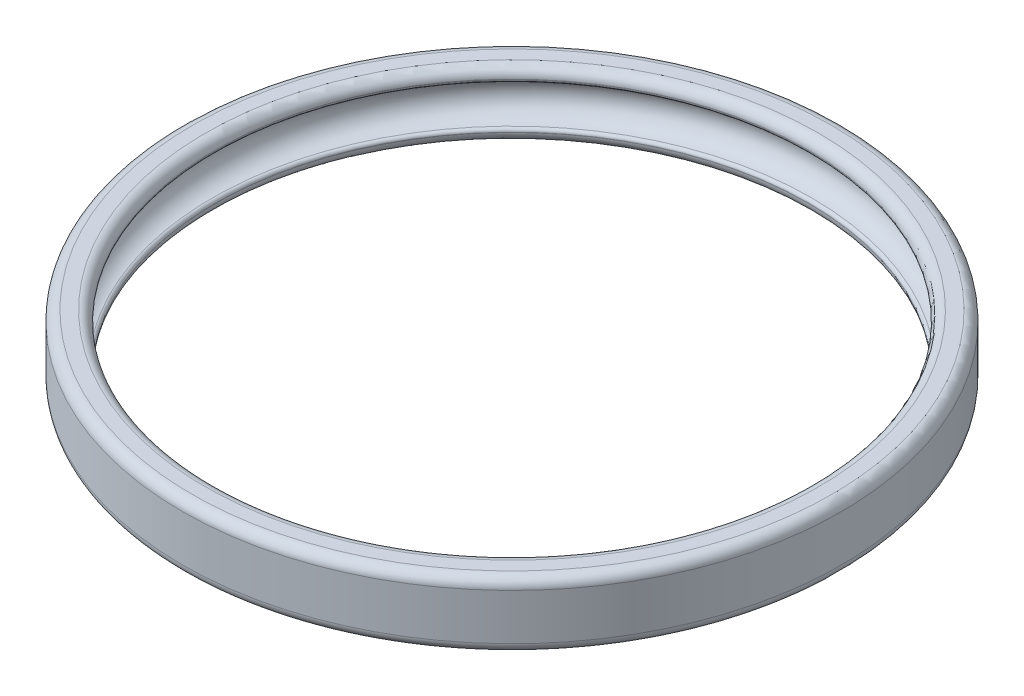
ISO-10303-21;
HEADER;
FILE_DESCRIPTION(('STEP AP214'),'2;1');
FILE_NAME('part.step','',(''),(''),'','','');
FILE_SCHEMA(('AUTOMOTIVE_DESIGN { 1 0 10303 214 1 1 1 1 }'));
ENDSEC;
DATA;
#1=APPLICATION_CONTEXT('core data for automotive mechanical design processes');
#2=APPLICATION_PROTOCOL_DEFINITION('international standard','automotive_design',2000,#1);
#3=PRODUCT_CONTEXT('',#1,'mechanical');
#4=PRODUCT('Part','Part','',(#3));
#5=PRODUCT_RELATED_PRODUCT_CATEGORY('part','',(#4));
#6=PRODUCT_DEFINITION_FORMATION('','',#4);
#7=PRODUCT_DEFINITION_CONTEXT('part definition',#1,'design');
#8=PRODUCT_DEFINITION('design','',#6,#7);
#9=PRODUCT_DEFINITION_SHAPE('','',#8);
#10=(LENGTH_UNIT() NAMED_UNIT(*) SI_UNIT(.MILLI.,.METRE.));
#11=(NAMED_UNIT(*) PLANE_ANGLE_UNIT() SI_UNIT($,.RADIAN.));
#12=(NAMED_UNIT(*) SI_UNIT($,.STERADIAN.) SOLID_ANGLE_UNIT());
#13=UNCERTAINTY_MEASURE_WITH_UNIT(LENGTH_MEASURE(1.E-05),#10,'distance_accuracy_value','');
#14=(GEOMETRIC_REPRESENTATION_CONTEXT(3) GLOBAL_UNCERTAINTY_ASSIGNED_CONTEXT((#13)) GLOBAL_UNIT_ASSIGNED_CONTEXT((#10,
#11,#12)) REPRESENTATION_CONTEXT('',''));
#15=CARTESIAN_POINT('',(0.,0.,0.));
#16=DIRECTION('',(0.,0.,1.));
#17=DIRECTION('',(1.,0.,0.));
#18=AXIS2_PLACEMENT_3D('',#15,#16,#17);
#19=CARTESIAN_POINT('',(0.,8.5,0.));
#20=DIRECTION('',(0.,-1.,0.));
#21=DIRECTION('',(0.,0.,-1.));
#22=AXIS2_PLACEMENT_3D('',#19,#20,#21);
#23=TOROIDAL_SURFACE('',#22,46.5,1.5);
#24=CARTESIAN_POINT('',(0.,8.49999999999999,0.));
#25=DIRECTION('',(0.,-1.,0.));
#26=DIRECTION('',(0.,0.,-1.));
#27=AXIS2_PLACEMENT_3D('',#24,#25,#26);
#28=CIRCLE('',#27,45.);
#29=CARTESIAN_POINT('',(0.,8.49999999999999,-45.));
#30=VERTEX_POINT('',#29);
#31=EDGE_CURVE('E74',#30,#30,#28,.T.);
#32=ORIENTED_EDGE('',*,*,#31,.T.);
#33=EDGE_LOOP('',(#32));
#34=FACE_BOUND('',#33,.T.);
#35=CARTESIAN_POINT('',(0.,10.,0.));
#36=DIRECTION('',(0.,-1.,0.));
#37=DIRECTION('',(0.,0.,-1.));
#38=AXIS2_PLACEMENT_3D('',#35,#36,#37);
#39=CIRCLE('',#38,46.5);
#40=CARTESIAN_POINT('',(0.,10.,-46.5));
#41=VERTEX_POINT('',#40);
#42=EDGE_CURVE('E10',#41,#41,#39,.T.);
#43=ORIENTED_EDGE('',*,*,#42,.F.);
#44=EDGE_LOOP('',(#43));
#45=FACE_BOUND('',#44,.T.);
#46=ADVANCED_FACE('F34',(#34,#45),#23,.T.);
#47=CARTESIAN_POINT('',(46.5,10.,0.));
#48=DIRECTION('',(0.,1.,0.));
#49=DIRECTION('',(0.,0.,1.));
#50=AXIS2_PLACEMENT_3D('',#47,#48,#49);
#51=PLANE('',#50);
#52=ORIENTED_EDGE('',*,*,#42,.T.);
#53=EDGE_LOOP('',(#52));
#54=FACE_BOUND('',#53,.T.);
#55=CARTESIAN_POINT('',(0.,10.,0.));
#56=DIRECTION('',(0.,-1.,0.));
#57=DIRECTION('',(0.,0.,-1.));
#58=AXIS2_PLACEMENT_3D('',#55,#56,#57);
#59=CIRCLE('',#58,48.5);
#60=CARTESIAN_POINT('',(0.,10.,-48.5));
#61=VERTEX_POINT('',#60);
#62=EDGE_CURVE('E40',#61,#61,#59,.T.);
#63=ORIENTED_EDGE('',*,*,#62,.F.);
#64=EDGE_LOOP('',(#63));
#65=FACE_BOUND('',#64,.T.);
#66=ADVANCED_FACE('F92',(#54,#65),#51,.T.);
#67=CARTESIAN_POINT('',(0.,8.5,0.));
#68=DIRECTION('',(0.,-1.,0.));
#69=DIRECTION('',(0.,0.,-1.));
#70=AXIS2_PLACEMENT_3D('',#67,#68,#69);
#71=TOROIDAL_SURFACE('',#70,48.5,1.5);
#72=ORIENTED_EDGE('',*,*,#62,.T.);
#73=EDGE_LOOP('',(#72));
#74=FACE_BOUND('',#73,.T.);
#75=CARTESIAN_POINT('',(0.,8.49999999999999,0.));
#76=DIRECTION('',(0.,-1.,0.));
#77=DIRECTION('',(0.,0.,-1.));
#78=AXIS2_PLACEMENT_3D('',#75,#76,#77);
#79=CIRCLE('',#78,50.);
#80=CARTESIAN_POINT('',(0.,8.49999999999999,-50.));
#81=VERTEX_POINT('',#80);
#82=EDGE_CURVE('E44',#81,#81,#79,.T.);
#83=ORIENTED_EDGE('',*,*,#82,.F.);
#84=EDGE_LOOP('',(#83));
#85=FACE_BOUND('',#84,.T.);
#86=ADVANCED_FACE('F96',(#74,#85),#71,.T.);
#87=CARTESIAN_POINT('',(0.,0.,0.));
#88=DIRECTION('',(0.,-1.,0.));
#89=DIRECTION('',(0.,0.,-1.));
#90=AXIS2_PLACEMENT_3D('',#87,#88,#89);
#91=CYLINDRICAL_SURFACE('',#90,50.);
#92=ORIENTED_EDGE('',*,*,#82,.T.);
#93=EDGE_LOOP('',(#92));
#94=FACE_BOUND('',#93,.T.);
#95=CARTESIAN_POINT('',(0.,1.5,0.));
#96=DIRECTION('',(0.,-1.,0.));
#97=DIRECTION('',(0.,0.,-1.));
#98=AXIS2_PLACEMENT_3D('',#95,#96,#97);
#99=CIRCLE('',#98,50.);
#100=CARTESIAN_POINT('',(0.,1.5,-50.));
#101=VERTEX_POINT('',#100);
#102=EDGE_CURVE('E48',#101,#101,#99,.T.);
#103=ORIENTED_EDGE('',*,*,#102,.F.);
#104=EDGE_LOOP('',(#103));
#105=FACE_BOUND('',#104,.T.);
#106=ADVANCED_FACE('F100',(#94,#105),#91,.T.);
#107=CARTESIAN_POINT('',(0.,1.5,0.));
#108=DIRECTION('',(0.,-1.,0.));
#109=DIRECTION('',(0.,0.,-1.));
#110=AXIS2_PLACEMENT_3D('',#107,#108,#109);
#111=TOROIDAL_SURFACE('',#110,48.5,1.5);
#112=ORIENTED_EDGE('',*,*,#102,.T.);
#113=EDGE_LOOP('',(#112));
#114=FACE_BOUND('',#113,.T.);
#115=CARTESIAN_POINT('',(0.,0.,0.));
#116=DIRECTION('',(0.,-1.,0.));
#117=DIRECTION('',(0.,0.,-1.));
#118=AXIS2_PLACEMENT_3D('',#115,#116,#117);
#119=CIRCLE('',#118,48.5);
#120=CARTESIAN_POINT('',(0.,0.,-48.5));
#121=VERTEX_POINT('',#120);
#122=EDGE_CURVE('E53',#121,#121,#119,.T.);
#123=ORIENTED_EDGE('',*,*,#122,.F.);
#124=EDGE_LOOP('',(#123));
#125=FACE_BOUND('',#124,.T.);
#126=ADVANCED_FACE('F106',(#114,#125),#111,.T.);
#127=CARTESIAN_POINT('',(46.5,0.,0.));
#128=DIRECTION('',(0.,-1.,0.));
#129=DIRECTION('',(0.,0.,-1.));
#130=AXIS2_PLACEMENT_3D('',#127,#128,#129);
#131=PLANE('',#130);
#132=ORIENTED_EDGE('',*,*,#122,.T.);
#133=EDGE_LOOP('',(#132));
#134=FACE_BOUND('',#133,.T.);
#135=CARTESIAN_POINT('',(0.,0.,0.));
#136=DIRECTION('',(0.,-1.,0.));
#137=DIRECTION('',(0.,0.,-1.));
#138=AXIS2_PLACEMENT_3D('',#135,#136,#137);
#139=CIRCLE('',#138,46.5);
#140=CARTESIAN_POINT('',(0.,0.,-46.5));
#141=VERTEX_POINT('',#140);
#142=EDGE_CURVE('E56',#141,#141,#139,.T.);
#143=ORIENTED_EDGE('',*,*,#142,.F.);
#144=EDGE_LOOP('',(#143));
#145=FACE_BOUND('',#144,.T.);
#146=ADVANCED_FACE('F110',(#134,#145),#131,.T.);
#147=CARTESIAN_POINT('',(0.,1.5,0.));
#148=DIRECTION('',(0.,-1.,0.));
#149=DIRECTION('',(0.,0.,-1.));
#150=AXIS2_PLACEMENT_3D('',#147,#148,#149);
#151=TOROIDAL_SURFACE('',#150,46.5,1.5);
#152=ORIENTED_EDGE('',*,*,#142,.T.);
#153=EDGE_LOOP('',(#152));
#154=FACE_BOUND('',#153,.T.);
#155=CARTESIAN_POINT('',(0.,1.50000000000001,0.));
#156=DIRECTION('',(0.,-1.,0.));
#157=DIRECTION('',(0.,0.,-1.));
#158=AXIS2_PLACEMENT_3D('',#155,#156,#157);
#159=CIRCLE('',#158,45.);
#160=CARTESIAN_POINT('',(0.,1.50000000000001,-45.));
#161=VERTEX_POINT('',#160);
#162=EDGE_CURVE('E59',#161,#161,#159,.T.);
#163=ORIENTED_EDGE('',*,*,#162,.F.);
#164=EDGE_LOOP('',(#163));
#165=FACE_BOUND('',#164,.T.);
#166=ADVANCED_FACE('F114',(#154,#165),#151,.T.);
#167=CARTESIAN_POINT('',(0.,0.,0.));
#168=DIRECTION('',(0.,-1.,0.));
#169=DIRECTION('',(0.,0.,-1.));
#170=AXIS2_PLACEMENT_3D('',#167,#168,#169);
#171=CYLINDRICAL_SURFACE('',#170,45.);
#172=ORIENTED_EDGE('',*,*,#162,.T.);
#173=EDGE_LOOP('',(#172));
#174=FACE_BOUND('',#173,.T.);
#175=CARTESIAN_POINT('',(0.,1.53589838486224,0.));
#176=DIRECTION('',(0.,-1.,0.));
#177=DIRECTION('',(0.,0.,-1.));
#178=AXIS2_PLACEMENT_3D('',#175,#176,#177);
#179=CIRCLE('',#178,45.);
#180=CARTESIAN_POINT('',(0.,1.53589838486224,-45.));
#181=VERTEX_POINT('',#180);
#182=EDGE_CURVE('E62',#181,#181,#179,.T.);
#183=ORIENTED_EDGE('',*,*,#182,.F.);
#184=EDGE_LOOP('',(#183));
#185=FACE_BOUND('',#184,.T.);
#186=ADVANCED_FACE('F118',(#174,#185),#171,.F.);
#187=CARTESIAN_POINT('',(0.,1.53589838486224,0.));
#188=DIRECTION('',(0.,-1.,0.));
#189=DIRECTION('',(0.,0.,-1.));
#190=AXIS2_PLACEMENT_3D('',#187,#188,#189);
#191=TOROIDAL_SURFACE('',#190,45.5,0.5);
#192=ORIENTED_EDGE('',*,*,#182,.T.);
#193=EDGE_LOOP('',(#192));
#194=FACE_BOUND('',#193,.T.);
#195=CARTESIAN_POINT('',(0.,2.03077004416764,0.));
#196=DIRECTION('',(0.,-1.,0.));
#197=DIRECTION('',(0.,0.,-1.));
#198=AXIS2_PLACEMENT_3D('',#195,#196,#197);
#199=CIRCLE('',#198,45.4285714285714);
#200=CARTESIAN_POINT('',(0.,2.03077004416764,-45.4285714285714));
#201=VERTEX_POINT('',#200);
#202=EDGE_CURVE('E65',#201,#201,#199,.T.);
#203=ORIENTED_EDGE('',*,*,#202,.F.);
#204=EDGE_LOOP('',(#203));
#205=FACE_BOUND('',#204,.T.);
#206=ADVANCED_FACE('F122',(#194,#205),#191,.T.);
#207=CARTESIAN_POINT('',(0.,5.,0.));
#208=DIRECTION('',(0.,-1.,0.));
#209=DIRECTION('',(0.,0.,-1.));
#210=AXIS2_PLACEMENT_3D('',#207,#208,#209);
#211=TOROIDAL_SURFACE('',#210,45.,3.);
#212=ORIENTED_EDGE('',*,*,#202,.T.);
#213=EDGE_LOOP('',(#212));
#214=FACE_BOUND('',#213,.T.);
#215=CARTESIAN_POINT('',(0.,7.96922995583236,0.));
#216=DIRECTION('',(0.,-1.,0.));
#217=DIRECTION('',(0.,0.,-1.));
#218=AXIS2_PLACEMENT_3D('',#215,#216,#217);
#219=CIRCLE('',#218,45.4285714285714);
#220=CARTESIAN_POINT('',(0.,7.96922995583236,-45.4285714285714));
#221=VERTEX_POINT('',#220);
#222=EDGE_CURVE('E68',#221,#221,#219,.T.);
#223=ORIENTED_EDGE('',*,*,#222,.F.);
#224=EDGE_LOOP('',(#223));
#225=FACE_BOUND('',#224,.T.);
#226=ADVANCED_FACE('F88',(#214,#225),#211,.F.);
#227=CARTESIAN_POINT('',(0.,8.46410161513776,0.));
#228=DIRECTION('',(0.,-1.,0.));
#229=DIRECTION('',(0.,0.,-1.));
#230=AXIS2_PLACEMENT_3D('',#227,#228,#229);
#231=TOROIDAL_SURFACE('',#230,45.5,0.5);
#232=ORIENTED_EDGE('',*,*,#222,.T.);
#233=EDGE_LOOP('',(#232));
#234=FACE_BOUND('',#233,.T.);
#235=CARTESIAN_POINT('',(0.,8.46410161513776,0.));
#236=DIRECTION('',(0.,-1.,0.));
#237=DIRECTION('',(0.,0.,-1.));
#238=AXIS2_PLACEMENT_3D('',#235,#236,#237);
#239=CIRCLE('',#238,45.);
#240=CARTESIAN_POINT('',(0.,8.46410161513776,-45.));
#241=VERTEX_POINT('',#240);
#242=EDGE_CURVE('E71',#241,#241,#239,.T.);
#243=ORIENTED_EDGE('',*,*,#242,.F.);
#244=EDGE_LOOP('',(#243));
#245=FACE_BOUND('',#244,.T.);
#246=ADVANCED_FACE('F82',(#234,#245),#231,.T.);
#247=CARTESIAN_POINT('',(0.,0.,0.));
#248=DIRECTION('',(0.,-1.,0.));
#249=DIRECTION('',(0.,0.,-1.));
#250=AXIS2_PLACEMENT_3D('',#247,#248,#249);
#251=CYLINDRICAL_SURFACE('',#250,45.);
#252=ORIENTED_EDGE('',*,*,#242,.T.);
#253=EDGE_LOOP('',(#252));
#254=FACE_BOUND('',#253,.T.);
#255=ORIENTED_EDGE('',*,*,#31,.F.);
#256=EDGE_LOOP('',(#255));
#257=FACE_BOUND('',#256,.T.);
#258=ADVANCED_FACE('F80',(#254,#257),#251,.F.);
#259=CLOSED_SHELL('',(#46,#66,#86,#106,#126,#146,#166,#186,#206,#226,#246,#258));
#260=MANIFOLD_SOLID_BREP('B2',#259);
#261=ADVANCED_BREP_SHAPE_REPRESENTATION('',(#18,#260),#14);
#262=SHAPE_DEFINITION_REPRESENTATION(#9,#261);
ENDSEC;
END-ISO-10303-21;
